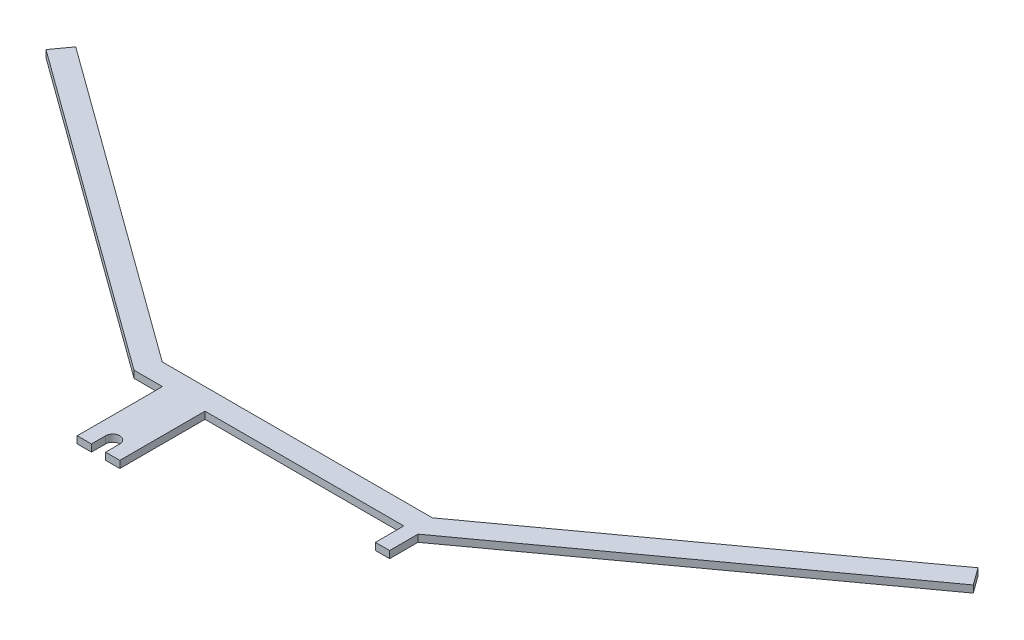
ISO-10303-21;
HEADER;
FILE_DESCRIPTION(('STEP AP214'),'2;1');
FILE_NAME('part.step','',(''),(''),'','','');
FILE_SCHEMA(('AUTOMOTIVE_DESIGN { 1 0 10303 214 1 1 1 1 }'));
ENDSEC;
DATA;
#1=APPLICATION_CONTEXT('core data for automotive mechanical design processes');
#2=APPLICATION_PROTOCOL_DEFINITION('international standard','automotive_design',2000,#1);
#3=PRODUCT_CONTEXT('',#1,'mechanical');
#4=PRODUCT('Part','Part','',(#3));
#5=PRODUCT_RELATED_PRODUCT_CATEGORY('part','',(#4));
#6=PRODUCT_DEFINITION_FORMATION('','',#4);
#7=PRODUCT_DEFINITION_CONTEXT('part definition',#1,'design');
#8=PRODUCT_DEFINITION('design','',#6,#7);
#9=PRODUCT_DEFINITION_SHAPE('','',#8);
#10=(LENGTH_UNIT() NAMED_UNIT(*) SI_UNIT(.MILLI.,.METRE.));
#11=(NAMED_UNIT(*) PLANE_ANGLE_UNIT() SI_UNIT($,.RADIAN.));
#12=(NAMED_UNIT(*) SI_UNIT($,.STERADIAN.) SOLID_ANGLE_UNIT());
#13=UNCERTAINTY_MEASURE_WITH_UNIT(LENGTH_MEASURE(1.E-05),#10,'distance_accuracy_value','');
#14=(GEOMETRIC_REPRESENTATION_CONTEXT(3) GLOBAL_UNCERTAINTY_ASSIGNED_CONTEXT((#13)) GLOBAL_UNIT_ASSIGNED_CONTEXT((#10,
#11,#12)) REPRESENTATION_CONTEXT('',''));
#15=CARTESIAN_POINT('',(0.,0.,0.));
#16=DIRECTION('',(0.,0.,1.));
#17=DIRECTION('',(1.,0.,0.));
#18=AXIS2_PLACEMENT_3D('',#15,#16,#17);
#19=CARTESIAN_POINT('',(-5.00000000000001,6.95820393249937,52.5));
#20=DIRECTION('',(0.,0.,1.));
#21=DIRECTION('',(1.,0.,0.));
#22=AXIS2_PLACEMENT_3D('',#19,#20,#21);
#23=PLANE('',#22);
#24=DIRECTION('',(0.,-1.,0.));
#25=VECTOR('',#24,1.);
#26=CARTESIAN_POINT('',(-7.00000000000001,6.95820393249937,52.5));
#27=LINE('',#26,#25);
#28=CARTESIAN_POINT('',(-7.00000000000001,0.250000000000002,52.5));
#29=VERTEX_POINT('',#28);
#30=CARTESIAN_POINT('',(-7.00000000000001,-0.25,52.5));
#31=VERTEX_POINT('',#30);
#32=EDGE_CURVE('E11',#29,#31,#27,.T.);
#33=ORIENTED_EDGE('',*,*,#32,.F.);
#34=DIRECTION('',(-1.,0.,0.));
#35=VECTOR('',#34,1.);
#36=CARTESIAN_POINT('',(-5.00000000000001,0.25,52.5));
#37=LINE('',#36,#35);
#38=CARTESIAN_POINT('',(-8.00000000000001,0.250000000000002,52.5));
#39=VERTEX_POINT('',#38);
#40=EDGE_CURVE('E246',#29,#39,#37,.T.);
#41=ORIENTED_EDGE('',*,*,#40,.T.);
#42=DIRECTION('',(0.,-1.,0.));
#43=VECTOR('',#42,1.);
#44=CARTESIAN_POINT('',(-8.00000000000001,6.95820393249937,52.5));
#45=LINE('',#44,#43);
#46=CARTESIAN_POINT('',(-8.00000000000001,-0.25,52.5));
#47=VERTEX_POINT('',#46);
#48=EDGE_CURVE('E245',#39,#47,#45,.T.);
#49=ORIENTED_EDGE('',*,*,#48,.T.);
#50=DIRECTION('',(-1.,0.,0.));
#51=VECTOR('',#50,1.);
#52=CARTESIAN_POINT('',(-5.00000000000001,-0.25,52.5));
#53=LINE('',#52,#51);
#54=EDGE_CURVE('E345',#31,#47,#53,.T.);
#55=ORIENTED_EDGE('',*,*,#54,.F.);
#56=EDGE_LOOP('',(#33,#41,#49,#55));
#57=FACE_BOUND('',#56,.T.);
#58=ADVANCED_FACE('F34',(#57),#23,.T.);
#59=CARTESIAN_POINT('',(-9.99999999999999,0.25,46.5));
#60=DIRECTION('',(0.,0.,-1.));
#61=DIRECTION('',(-1.,0.,0.));
#62=AXIS2_PLACEMENT_3D('',#59,#60,#61);
#63=PLANE('',#62);
#64=DIRECTION('',(1.,0.,0.));
#65=VECTOR('',#64,1.);
#66=CARTESIAN_POINT('',(-9.99999999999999,-0.25,46.5));
#67=LINE('',#66,#65);
#68=CARTESIAN_POINT('',(-9.99999999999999,-0.25,46.5));
#69=VERTEX_POINT('',#68);
#70=CARTESIAN_POINT('',(-8.00000000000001,-0.25,46.5));
#71=VERTEX_POINT('',#70);
#72=EDGE_CURVE('E161',#69,#71,#67,.T.);
#73=ORIENTED_EDGE('',*,*,#72,.T.);
#74=DIRECTION('',(0.,-1.,0.));
#75=VECTOR('',#74,1.);
#76=CARTESIAN_POINT('',(-8.00000000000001,6.95820393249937,46.5));
#77=LINE('',#76,#75);
#78=CARTESIAN_POINT('',(-8.00000000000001,0.25,46.5));
#79=VERTEX_POINT('',#78);
#80=EDGE_CURVE('E260',#79,#71,#77,.T.);
#81=ORIENTED_EDGE('',*,*,#80,.F.);
#82=DIRECTION('',(1.,0.,0.));
#83=VECTOR('',#82,1.);
#84=CARTESIAN_POINT('',(-9.99999999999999,0.25,46.5));
#85=LINE('',#84,#83);
#86=CARTESIAN_POINT('',(-9.99999999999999,0.250000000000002,46.5));
#87=VERTEX_POINT('',#86);
#88=EDGE_CURVE('E178',#87,#79,#85,.T.);
#89=ORIENTED_EDGE('',*,*,#88,.F.);
#90=DIRECTION('',(0.,-1.,0.));
#91=VECTOR('',#90,1.);
#92=CARTESIAN_POINT('',(-9.99999999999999,0.25,46.5));
#93=LINE('',#92,#91);
#94=EDGE_CURVE('E175',#87,#69,#93,.T.);
#95=ORIENTED_EDGE('',*,*,#94,.T.);
#96=EDGE_LOOP('',(#73,#81,#89,#95));
#97=FACE_BOUND('',#96,.T.);
#98=ADVANCED_FACE('F176',(#97),#63,.F.);
#99=CARTESIAN_POINT('',(-5.00000000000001,-0.25,46.5));
#100=VERTEX_POINT('',#99);
#101=CARTESIAN_POINT('',(8.99999999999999,-0.25,46.5));
#102=VERTEX_POINT('',#101);
#103=EDGE_CURVE('E54',#100,#102,#67,.T.);
#104=ORIENTED_EDGE('',*,*,#103,.T.);
#105=DIRECTION('',(0.,-1.,0.));
#106=VECTOR('',#105,1.);
#107=CARTESIAN_POINT('',(8.99999999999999,2.48606797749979,46.5));
#108=LINE('',#107,#106);
#109=CARTESIAN_POINT('',(8.99999999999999,0.25,46.5));
#110=VERTEX_POINT('',#109);
#111=EDGE_CURVE('E49',#110,#102,#108,.T.);
#112=ORIENTED_EDGE('',*,*,#111,.F.);
#113=CARTESIAN_POINT('',(-5.00000000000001,0.25,46.5));
#114=VERTEX_POINT('',#113);
#115=EDGE_CURVE('E268',#114,#110,#85,.T.);
#116=ORIENTED_EDGE('',*,*,#115,.F.);
#117=DIRECTION('',(0.,-1.,0.));
#118=VECTOR('',#117,1.);
#119=CARTESIAN_POINT('',(-5.00000000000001,6.95820393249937,46.5));
#120=LINE('',#119,#118);
#121=EDGE_CURVE('E257',#114,#100,#120,.T.);
#122=ORIENTED_EDGE('',*,*,#121,.T.);
#123=EDGE_LOOP('',(#104,#112,#116,#122));
#124=FACE_BOUND('',#123,.T.);
#125=ADVANCED_FACE('F379',(#124),#63,.F.);
#126=CARTESIAN_POINT('',(-31.7734222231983,0.25,28.831720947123));
#127=DIRECTION('',(0.809104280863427,0.,0.587665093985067));
#128=DIRECTION('',(0.587665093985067,0.,-0.809104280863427));
#129=AXIS2_PLACEMENT_3D('',#126,#127,#128);
#130=PLANE('',#129);
#131=DIRECTION('',(-0.587665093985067,0.,0.809104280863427));
#132=VECTOR('',#131,1.);
#133=CARTESIAN_POINT('',(-31.7734222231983,-0.25,28.831720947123));
#134=LINE('',#133,#132);
#135=CARTESIAN_POINT('',(-31.7734222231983,-0.25,28.831720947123));
#136=VERTEX_POINT('',#135);
#137=CARTESIAN_POINT('',(-32.6549198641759,-0.25,30.0453773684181));
#138=VERTEX_POINT('',#137);
#139=EDGE_CURVE('E187',#136,#138,#134,.T.);
#140=ORIENTED_EDGE('',*,*,#139,.T.);
#141=DIRECTION('',(0.,-1.,0.));
#142=VECTOR('',#141,1.);
#143=CARTESIAN_POINT('',(-32.6549198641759,0.25,30.0453773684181));
#144=LINE('',#143,#142);
#145=CARTESIAN_POINT('',(-32.6549198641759,0.25,30.0453773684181));
#146=VERTEX_POINT('',#145);
#147=EDGE_CURVE('E181',#146,#138,#144,.T.);
#148=ORIENTED_EDGE('',*,*,#147,.F.);
#149=DIRECTION('',(-0.587665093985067,0.,0.809104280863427));
#150=VECTOR('',#149,1.);
#151=CARTESIAN_POINT('',(-31.7734222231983,0.25,28.831720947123));
#152=LINE('',#151,#150);
#153=CARTESIAN_POINT('',(-31.7734222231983,0.25,28.831720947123));
#154=VERTEX_POINT('',#153);
#155=EDGE_CURVE('E202',#154,#146,#152,.T.);
#156=ORIENTED_EDGE('',*,*,#155,.F.);
#157=DIRECTION('',(0.,-1.,0.));
#158=VECTOR('',#157,1.);
#159=CARTESIAN_POINT('',(-31.7734222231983,0.25,28.831720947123));
#160=LINE('',#159,#158);
#161=EDGE_CURVE('E203',#154,#136,#160,.T.);
#162=ORIENTED_EDGE('',*,*,#161,.T.);
#163=EDGE_LOOP('',(#140,#148,#156,#162));
#164=FACE_BOUND('',#163,.T.);
#165=ADVANCED_FACE('F36',(#164),#130,.F.);
#166=CARTESIAN_POINT('',(-32.6549198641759,0.25,30.0453773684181));
#167=DIRECTION('',(0.587665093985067,0.,-0.809104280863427));
#168=DIRECTION('',(-0.809104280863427,0.,-0.587665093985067));
#169=AXIS2_PLACEMENT_3D('',#166,#167,#168);
#170=PLANE('',#169);
#171=DIRECTION('',(0.809104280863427,0.,0.587665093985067));
#172=VECTOR('',#171,1.);
#173=CARTESIAN_POINT('',(-32.6549198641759,-0.25,30.0453773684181));
#174=LINE('',#173,#172);
#175=EDGE_CURVE('E166',#138,#69,#174,.T.);
#176=ORIENTED_EDGE('',*,*,#175,.T.);
#177=ORIENTED_EDGE('',*,*,#94,.F.);
#178=DIRECTION('',(0.809104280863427,0.,0.587665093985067));
#179=VECTOR('',#178,1.);
#180=CARTESIAN_POINT('',(-32.6549198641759,0.25,30.0453773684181));
#181=LINE('',#180,#179);
#182=EDGE_CURVE('E266',#146,#87,#181,.T.);
#183=ORIENTED_EDGE('',*,*,#182,.F.);
#184=ORIENTED_EDGE('',*,*,#147,.T.);
#185=EDGE_LOOP('',(#176,#177,#183,#184));
#186=FACE_BOUND('',#185,.T.);
#187=ADVANCED_FACE('F184',(#186),#170,.F.);
#188=CARTESIAN_POINT('',(32.654919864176,0.25,30.0453773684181));
#189=DIRECTION('',(-0.587665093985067,0.,-0.809104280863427));
#190=DIRECTION('',(-0.809104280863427,0.,0.587665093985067));
#191=AXIS2_PLACEMENT_3D('',#188,#189,#190);
#192=PLANE('',#191);
#193=DIRECTION('',(0.809104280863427,0.,-0.587665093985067));
#194=VECTOR('',#193,1.);
#195=CARTESIAN_POINT('',(32.654919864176,-0.25,30.0453773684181));
#196=LINE('',#195,#194);
#197=CARTESIAN_POINT('',(9.99999999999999,-0.25,46.5));
#198=VERTEX_POINT('',#197);
#199=CARTESIAN_POINT('',(32.654919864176,-0.25,30.0453773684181));
#200=VERTEX_POINT('',#199);
#201=EDGE_CURVE('E172',#198,#200,#196,.T.);
#202=ORIENTED_EDGE('',*,*,#201,.T.);
#203=DIRECTION('',(0.,-1.,0.));
#204=VECTOR('',#203,1.);
#205=CARTESIAN_POINT('',(32.654919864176,0.25,30.0453773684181));
#206=LINE('',#205,#204);
#207=CARTESIAN_POINT('',(32.654919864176,0.25,30.0453773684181));
#208=VERTEX_POINT('',#207);
#209=EDGE_CURVE('E216',#208,#200,#206,.T.);
#210=ORIENTED_EDGE('',*,*,#209,.F.);
#211=DIRECTION('',(0.809104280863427,0.,-0.587665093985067));
#212=VECTOR('',#211,1.);
#213=CARTESIAN_POINT('',(32.654919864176,0.25,30.0453773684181));
#214=LINE('',#213,#212);
#215=CARTESIAN_POINT('',(9.99999999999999,0.25,46.5));
#216=VERTEX_POINT('',#215);
#217=EDGE_CURVE('E270',#216,#208,#214,.T.);
#218=ORIENTED_EDGE('',*,*,#217,.F.);
#219=DIRECTION('',(0.,-1.,0.));
#220=VECTOR('',#219,1.);
#221=CARTESIAN_POINT('',(10.,0.25,46.5));
#222=LINE('',#221,#220);
#223=EDGE_CURVE('E182',#216,#198,#222,.T.);
#224=ORIENTED_EDGE('',*,*,#223,.T.);
#225=EDGE_LOOP('',(#202,#210,#218,#224));
#226=FACE_BOUND('',#225,.T.);
#227=ADVANCED_FACE('F361',(#226),#192,.F.);
#228=CARTESIAN_POINT('',(31.7734222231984,0.25,28.831720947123));
#229=DIRECTION('',(-0.809104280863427,0.,0.587665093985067));
#230=DIRECTION('',(0.587665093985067,0.,0.809104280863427));
#231=AXIS2_PLACEMENT_3D('',#228,#229,#230);
#232=PLANE('',#231);
#233=DIRECTION('',(-0.587665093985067,0.,-0.809104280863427));
#234=VECTOR('',#233,1.);
#235=CARTESIAN_POINT('',(31.7734222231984,-0.25,28.831720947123));
#236=LINE('',#235,#234);
#237=CARTESIAN_POINT('',(31.7734222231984,-0.25,28.831720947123));
#238=VERTEX_POINT('',#237);
#239=EDGE_CURVE('E194',#200,#238,#236,.T.);
#240=ORIENTED_EDGE('',*,*,#239,.T.);
#241=DIRECTION('',(0.,-1.,0.));
#242=VECTOR('',#241,1.);
#243=CARTESIAN_POINT('',(31.7734222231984,0.25,28.831720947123));
#244=LINE('',#243,#242);
#245=CARTESIAN_POINT('',(31.7734222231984,0.25,28.831720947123));
#246=VERTEX_POINT('',#245);
#247=EDGE_CURVE('E213',#246,#238,#244,.T.);
#248=ORIENTED_EDGE('',*,*,#247,.F.);
#249=DIRECTION('',(-0.587665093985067,0.,-0.809104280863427));
#250=VECTOR('',#249,1.);
#251=CARTESIAN_POINT('',(31.7734222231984,0.25,28.831720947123));
#252=LINE('',#251,#250);
#253=EDGE_CURVE('E272',#208,#246,#252,.T.);
#254=ORIENTED_EDGE('',*,*,#253,.F.);
#255=ORIENTED_EDGE('',*,*,#209,.T.);
#256=EDGE_LOOP('',(#240,#248,#254,#255));
#257=FACE_BOUND('',#256,.T.);
#258=ADVANCED_FACE('F298',(#257),#232,.F.);
#259=CARTESIAN_POINT('',(31.7734222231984,0.25,28.831720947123));
#260=DIRECTION('',(0.587665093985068,0.,0.809104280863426));
#261=DIRECTION('',(0.809104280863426,0.,-0.587665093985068));
#262=AXIS2_PLACEMENT_3D('',#259,#260,#261);
#263=PLANE('',#262);
#264=DIRECTION('',(-0.809104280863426,0.,0.587665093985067));
#265=VECTOR('',#264,1.);
#266=CARTESIAN_POINT('',(31.7734222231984,-0.25,28.831720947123));
#267=LINE('',#266,#265);
#268=CARTESIAN_POINT('',(9.51274359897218,-0.25,45.));
#269=VERTEX_POINT('',#268);
#270=EDGE_CURVE('E196',#238,#269,#267,.T.);
#271=ORIENTED_EDGE('',*,*,#270,.T.);
#272=DIRECTION('',(0.,-1.,0.));
#273=VECTOR('',#272,1.);
#274=CARTESIAN_POINT('',(9.51274359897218,0.25,45.));
#275=LINE('',#274,#273);
#276=CARTESIAN_POINT('',(9.51274359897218,0.25,45.));
#277=VERTEX_POINT('',#276);
#278=EDGE_CURVE('E210',#277,#269,#275,.T.);
#279=ORIENTED_EDGE('',*,*,#278,.F.);
#280=DIRECTION('',(-0.809104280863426,0.,0.587665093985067));
#281=VECTOR('',#280,1.);
#282=CARTESIAN_POINT('',(31.7734222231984,0.25,28.831720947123));
#283=LINE('',#282,#281);
#284=EDGE_CURVE('E274',#246,#277,#283,.T.);
#285=ORIENTED_EDGE('',*,*,#284,.F.);
#286=ORIENTED_EDGE('',*,*,#247,.T.);
#287=EDGE_LOOP('',(#271,#279,#285,#286));
#288=FACE_BOUND('',#287,.T.);
#289=ADVANCED_FACE('F294',(#288),#263,.F.);
#290=CARTESIAN_POINT('',(-9.51274359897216,0.25,45.));
#291=DIRECTION('',(0.,0.,1.));
#292=DIRECTION('',(1.,0.,0.));
#293=AXIS2_PLACEMENT_3D('',#290,#291,#292);
#294=PLANE('',#293);
#295=DIRECTION('',(-1.,0.,0.));
#296=VECTOR('',#295,1.);
#297=CARTESIAN_POINT('',(-9.51274359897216,-0.25,45.));
#298=LINE('',#297,#296);
#299=CARTESIAN_POINT('',(-9.51274359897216,-0.25,45.));
#300=VERTEX_POINT('',#299);
#301=EDGE_CURVE('E198',#269,#300,#298,.T.);
#302=ORIENTED_EDGE('',*,*,#301,.T.);
#303=DIRECTION('',(0.,-1.,0.));
#304=VECTOR('',#303,1.);
#305=CARTESIAN_POINT('',(-9.51274359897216,0.25,45.));
#306=LINE('',#305,#304);
#307=CARTESIAN_POINT('',(-9.51274359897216,0.25,45.));
#308=VERTEX_POINT('',#307);
#309=EDGE_CURVE('E206',#308,#300,#306,.T.);
#310=ORIENTED_EDGE('',*,*,#309,.F.);
#311=DIRECTION('',(-1.,0.,0.));
#312=VECTOR('',#311,1.);
#313=CARTESIAN_POINT('',(-9.51274359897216,0.25,45.));
#314=LINE('',#313,#312);
#315=EDGE_CURVE('E276',#277,#308,#314,.T.);
#316=ORIENTED_EDGE('',*,*,#315,.F.);
#317=ORIENTED_EDGE('',*,*,#278,.T.);
#318=EDGE_LOOP('',(#302,#310,#316,#317));
#319=FACE_BOUND('',#318,.T.);
#320=ADVANCED_FACE('F290',(#319),#294,.F.);
#321=CARTESIAN_POINT('',(-31.7734222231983,0.25,28.831720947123));
#322=DIRECTION('',(-0.587665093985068,0.,0.809104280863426));
#323=DIRECTION('',(0.809104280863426,0.,0.587665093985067));
#324=AXIS2_PLACEMENT_3D('',#321,#322,#323);
#325=PLANE('',#324);
#326=DIRECTION('',(-0.809104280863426,0.,-0.587665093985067));
#327=VECTOR('',#326,1.);
#328=CARTESIAN_POINT('',(-31.7734222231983,-0.25,28.831720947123));
#329=LINE('',#328,#327);
#330=EDGE_CURVE('E200',#300,#136,#329,.T.);
#331=ORIENTED_EDGE('',*,*,#330,.T.);
#332=ORIENTED_EDGE('',*,*,#161,.F.);
#333=DIRECTION('',(-0.809104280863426,0.,-0.587665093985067));
#334=VECTOR('',#333,1.);
#335=CARTESIAN_POINT('',(-31.7734222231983,0.25,28.831720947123));
#336=LINE('',#335,#334);
#337=EDGE_CURVE('E207',#308,#154,#336,.T.);
#338=ORIENTED_EDGE('',*,*,#337,.F.);
#339=ORIENTED_EDGE('',*,*,#309,.T.);
#340=EDGE_LOOP('',(#331,#332,#338,#339));
#341=FACE_BOUND('',#340,.T.);
#342=ADVANCED_FACE('F283',(#341),#325,.F.);
#343=CARTESIAN_POINT('',(0.,0.25,0.));
#344=DIRECTION('',(0.,1.,0.));
#345=DIRECTION('',(0.,0.,1.));
#346=AXIS2_PLACEMENT_3D('',#343,#344,#345);
#347=PLANE('',#346);
#348=ORIENTED_EDGE('',*,*,#182,.T.);
#349=ORIENTED_EDGE('',*,*,#88,.T.);
#350=DIRECTION('',(0.,0.,-1.));
#351=VECTOR('',#350,1.);
#352=CARTESIAN_POINT('',(-8.00000000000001,0.25,46.5));
#353=LINE('',#352,#351);
#354=EDGE_CURVE('E249',#39,#79,#353,.T.);
#355=ORIENTED_EDGE('',*,*,#354,.F.);
#356=ORIENTED_EDGE('',*,*,#40,.F.);
#357=DIRECTION('',(0.,0.,-1.));
#358=VECTOR('',#357,1.);
#359=CARTESIAN_POINT('',(-7.00000000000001,0.250000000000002,51.5));
#360=LINE('',#359,#358);
#361=CARTESIAN_POINT('',(-7.00000000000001,0.250000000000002,51.5));
#362=VERTEX_POINT('',#361);
#363=EDGE_CURVE('E241',#29,#362,#360,.T.);
#364=ORIENTED_EDGE('',*,*,#363,.T.);
#365=CARTESIAN_POINT('',(-6.50000000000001,0.250000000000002,51.5));
#366=DIRECTION('',(0.,-1.,0.));
#367=DIRECTION('',(0.,0.,-1.));
#368=AXIS2_PLACEMENT_3D('',#365,#366,#367);
#369=CIRCLE('',#368,0.5);
#370=CARTESIAN_POINT('',(-6.00000000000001,0.250000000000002,51.5));
#371=VERTEX_POINT('',#370);
#372=EDGE_CURVE('E240',#362,#371,#369,.T.);
#373=ORIENTED_EDGE('',*,*,#372,.T.);
#374=DIRECTION('',(0.,0.,1.));
#375=VECTOR('',#374,1.);
#376=CARTESIAN_POINT('',(-6.00000000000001,0.250000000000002,55.2784134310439));
#377=LINE('',#376,#375);
#378=CARTESIAN_POINT('',(-6.00000000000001,0.250000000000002,52.5));
#379=VERTEX_POINT('',#378);
#380=EDGE_CURVE('E225',#371,#379,#377,.T.);
#381=ORIENTED_EDGE('',*,*,#380,.T.);
#382=CARTESIAN_POINT('',(-5.00000000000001,0.25,52.5));
#383=VERTEX_POINT('',#382);
#384=EDGE_CURVE('E236',#383,#379,#37,.T.);
#385=ORIENTED_EDGE('',*,*,#384,.F.);
#386=DIRECTION('',(0.,0.,1.));
#387=VECTOR('',#386,1.);
#388=CARTESIAN_POINT('',(-5.00000000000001,0.25,46.5));
#389=LINE('',#388,#387);
#390=EDGE_CURVE('E255',#114,#383,#389,.T.);
#391=ORIENTED_EDGE('',*,*,#390,.F.);
#392=ORIENTED_EDGE('',*,*,#115,.T.);
#393=DIRECTION('',(0.,0.,-1.));
#394=VECTOR('',#393,1.);
#395=CARTESIAN_POINT('',(8.99999999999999,0.25,48.5));
#396=LINE('',#395,#394);
#397=CARTESIAN_POINT('',(8.99999999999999,0.25,48.5));
#398=VERTEX_POINT('',#397);
#399=EDGE_CURVE('E321',#398,#110,#396,.T.);
#400=ORIENTED_EDGE('',*,*,#399,.F.);
#401=DIRECTION('',(-1.,0.,0.));
#402=VECTOR('',#401,1.);
#403=CARTESIAN_POINT('',(9.99999999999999,0.25,48.5));
#404=LINE('',#403,#402);
#405=CARTESIAN_POINT('',(9.99999999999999,0.25,48.5));
#406=VERTEX_POINT('',#405);
#407=EDGE_CURVE('E325',#406,#398,#404,.T.);
#408=ORIENTED_EDGE('',*,*,#407,.F.);
#409=DIRECTION('',(0.,0.,1.));
#410=VECTOR('',#409,1.);
#411=CARTESIAN_POINT('',(9.99999999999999,0.25,46.5));
#412=LINE('',#411,#410);
#413=EDGE_CURVE('E319',#216,#406,#412,.T.);
#414=ORIENTED_EDGE('',*,*,#413,.F.);
#415=ORIENTED_EDGE('',*,*,#217,.T.);
#416=ORIENTED_EDGE('',*,*,#253,.T.);
#417=ORIENTED_EDGE('',*,*,#284,.T.);
#418=ORIENTED_EDGE('',*,*,#315,.T.);
#419=ORIENTED_EDGE('',*,*,#337,.T.);
#420=ORIENTED_EDGE('',*,*,#155,.T.);
#421=EDGE_LOOP('',(#348,#349,#355,#356,#364,#373,#381,#385,#391,#392,#400,#408,#414,#415,#416,
#417,#418,#419,#420));
#422=FACE_BOUND('',#421,.T.);
#423=ADVANCED_FACE('F234',(#422),#347,.T.);
#424=CARTESIAN_POINT('',(0.,-0.25,0.));
#425=DIRECTION('',(0.,1.,0.));
#426=DIRECTION('',(0.,0.,1.));
#427=AXIS2_PLACEMENT_3D('',#424,#425,#426);
#428=PLANE('',#427);
#429=ORIENTED_EDGE('',*,*,#72,.F.);
#430=ORIENTED_EDGE('',*,*,#175,.F.);
#431=ORIENTED_EDGE('',*,*,#139,.F.);
#432=ORIENTED_EDGE('',*,*,#330,.F.);
#433=ORIENTED_EDGE('',*,*,#301,.F.);
#434=ORIENTED_EDGE('',*,*,#270,.F.);
#435=ORIENTED_EDGE('',*,*,#239,.F.);
#436=ORIENTED_EDGE('',*,*,#201,.F.);
#437=DIRECTION('',(0.,0.,1.));
#438=VECTOR('',#437,1.);
#439=CARTESIAN_POINT('',(9.99999999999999,-0.25,46.5));
#440=LINE('',#439,#438);
#441=CARTESIAN_POINT('',(9.99999999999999,-0.25,48.5));
#442=VERTEX_POINT('',#441);
#443=EDGE_CURVE('E304',#198,#442,#440,.T.);
#444=ORIENTED_EDGE('',*,*,#443,.T.);
#445=DIRECTION('',(-1.,0.,0.));
#446=VECTOR('',#445,1.);
#447=CARTESIAN_POINT('',(9.99999999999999,-0.25,48.5));
#448=LINE('',#447,#446);
#449=CARTESIAN_POINT('',(8.99999999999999,-0.25,48.5));
#450=VERTEX_POINT('',#449);
#451=EDGE_CURVE('E313',#442,#450,#448,.T.);
#452=ORIENTED_EDGE('',*,*,#451,.T.);
#453=DIRECTION('',(0.,0.,-1.));
#454=VECTOR('',#453,1.);
#455=CARTESIAN_POINT('',(8.99999999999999,-0.25,48.5));
#456=LINE('',#455,#454);
#457=EDGE_CURVE('E315',#450,#102,#456,.T.);
#458=ORIENTED_EDGE('',*,*,#457,.T.);
#459=ORIENTED_EDGE('',*,*,#103,.F.);
#460=DIRECTION('',(0.,0.,1.));
#461=VECTOR('',#460,1.);
#462=CARTESIAN_POINT('',(-5.00000000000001,-0.25,46.5));
#463=LINE('',#462,#461);
#464=CARTESIAN_POINT('',(-5.00000000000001,-0.25,52.5));
#465=VERTEX_POINT('',#464);
#466=EDGE_CURVE('E253',#100,#465,#463,.T.);
#467=ORIENTED_EDGE('',*,*,#466,.T.);
#468=CARTESIAN_POINT('',(-6.00000000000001,-0.25,52.5));
#469=VERTEX_POINT('',#468);
#470=EDGE_CURVE('E344',#465,#469,#53,.T.);
#471=ORIENTED_EDGE('',*,*,#470,.T.);
#472=DIRECTION('',(0.,0.,1.));
#473=VECTOR('',#472,1.);
#474=CARTESIAN_POINT('',(-6.00000000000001,-0.25,55.2784134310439));
#475=LINE('',#474,#473);
#476=CARTESIAN_POINT('',(-6.00000000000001,-0.25,51.5));
#477=VERTEX_POINT('',#476);
#478=EDGE_CURVE('E228',#477,#469,#475,.T.);
#479=ORIENTED_EDGE('',*,*,#478,.F.);
#480=CARTESIAN_POINT('',(-6.50000000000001,-0.25,51.5));
#481=DIRECTION('',(0.,-1.,0.));
#482=DIRECTION('',(0.,0.,-1.));
#483=AXIS2_PLACEMENT_3D('',#480,#481,#482);
#484=CIRCLE('',#483,0.5);
#485=CARTESIAN_POINT('',(-7.00000000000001,-0.25,51.5));
#486=VERTEX_POINT('',#485);
#487=EDGE_CURVE('E329',#486,#477,#484,.T.);
#488=ORIENTED_EDGE('',*,*,#487,.F.);
#489=DIRECTION('',(0.,0.,-1.));
#490=VECTOR('',#489,1.);
#491=CARTESIAN_POINT('',(-7.00000000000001,-0.25,51.5));
#492=LINE('',#491,#490);
#493=EDGE_CURVE('E332',#31,#486,#492,.T.);
#494=ORIENTED_EDGE('',*,*,#493,.F.);
#495=ORIENTED_EDGE('',*,*,#54,.T.);
#496=DIRECTION('',(0.,0.,-1.));
#497=VECTOR('',#496,1.);
#498=CARTESIAN_POINT('',(-8.00000000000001,-0.25,46.5));
#499=LINE('',#498,#497);
#500=EDGE_CURVE('E169',#47,#71,#499,.T.);
#501=ORIENTED_EDGE('',*,*,#500,.T.);
#502=EDGE_LOOP('',(#429,#430,#431,#432,#433,#434,#435,#436,#444,#452,#458,#459,#467,#471,#479,
#488,#494,#495,#501));
#503=FACE_BOUND('',#502,.T.);
#504=ADVANCED_FACE('F163',(#503),#428,.F.);
#505=DIRECTION('',(0.,1.,0.));
#506=VECTOR('',#505,1.);
#507=CARTESIAN_POINT('',(-6.00000000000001,6.95820393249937,52.5));
#508=LINE('',#507,#506);
#509=EDGE_CURVE('E42',#469,#379,#508,.T.);
#510=ORIENTED_EDGE('',*,*,#509,.F.);
#511=ORIENTED_EDGE('',*,*,#470,.F.);
#512=DIRECTION('',(0.,-1.,0.));
#513=VECTOR('',#512,1.);
#514=CARTESIAN_POINT('',(-5.00000000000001,6.95820393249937,52.5));
#515=LINE('',#514,#513);
#516=EDGE_CURVE('E189',#383,#465,#515,.T.);
#517=ORIENTED_EDGE('',*,*,#516,.F.);
#518=ORIENTED_EDGE('',*,*,#384,.T.);
#519=EDGE_LOOP('',(#510,#511,#517,#518));
#520=FACE_BOUND('',#519,.T.);
#521=ADVANCED_FACE('F244',(#520),#23,.T.);
#522=CARTESIAN_POINT('',(-8.00000000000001,6.95820393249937,46.5));
#523=DIRECTION('',(-1.,0.,0.));
#524=DIRECTION('',(0.,0.,1.));
#525=AXIS2_PLACEMENT_3D('',#522,#523,#524);
#526=PLANE('',#525);
#527=ORIENTED_EDGE('',*,*,#48,.F.);
#528=ORIENTED_EDGE('',*,*,#354,.T.);
#529=ORIENTED_EDGE('',*,*,#80,.T.);
#530=ORIENTED_EDGE('',*,*,#500,.F.);
#531=EDGE_LOOP('',(#527,#528,#529,#530));
#532=FACE_BOUND('',#531,.T.);
#533=ADVANCED_FACE('F384',(#532),#526,.T.);
#534=CARTESIAN_POINT('',(-5.00000000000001,6.95820393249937,46.5));
#535=DIRECTION('',(1.,0.,0.));
#536=DIRECTION('',(0.,0.,-1.));
#537=AXIS2_PLACEMENT_3D('',#534,#535,#536);
#538=PLANE('',#537);
#539=ORIENTED_EDGE('',*,*,#121,.F.);
#540=ORIENTED_EDGE('',*,*,#390,.T.);
#541=ORIENTED_EDGE('',*,*,#516,.T.);
#542=ORIENTED_EDGE('',*,*,#466,.F.);
#543=EDGE_LOOP('',(#539,#540,#541,#542));
#544=FACE_BOUND('',#543,.T.);
#545=ADVANCED_FACE('F353',(#544),#538,.T.);
#546=CARTESIAN_POINT('',(-6.50000000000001,0.250000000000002,51.5));
#547=DIRECTION('',(0.,-1.,0.));
#548=DIRECTION('',(0.,0.,-1.));
#549=AXIS2_PLACEMENT_3D('',#546,#547,#548);
#550=CYLINDRICAL_SURFACE('',#549,0.5);
#551=ORIENTED_EDGE('',*,*,#487,.T.);
#552=DIRECTION('',(0.,-1.,0.));
#553=VECTOR('',#552,1.);
#554=CARTESIAN_POINT('',(-6.00000000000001,0.250000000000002,51.5));
#555=LINE('',#554,#553);
#556=EDGE_CURVE('E335',#371,#477,#555,.T.);
#557=ORIENTED_EDGE('',*,*,#556,.F.);
#558=ORIENTED_EDGE('',*,*,#372,.F.);
#559=DIRECTION('',(0.,-1.,0.));
#560=VECTOR('',#559,1.);
#561=CARTESIAN_POINT('',(-7.00000000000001,0.250000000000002,51.5));
#562=LINE('',#561,#560);
#563=EDGE_CURVE('E340',#362,#486,#562,.T.);
#564=ORIENTED_EDGE('',*,*,#563,.T.);
#565=EDGE_LOOP('',(#551,#557,#558,#564));
#566=FACE_BOUND('',#565,.T.);
#567=ADVANCED_FACE('F428',(#566),#550,.F.);
#568=CARTESIAN_POINT('',(-7.00000000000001,0.250000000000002,51.5));
#569=DIRECTION('',(-1.,0.,0.));
#570=DIRECTION('',(0.,0.,1.));
#571=AXIS2_PLACEMENT_3D('',#568,#569,#570);
#572=PLANE('',#571);
#573=ORIENTED_EDGE('',*,*,#32,.T.);
#574=ORIENTED_EDGE('',*,*,#493,.T.);
#575=ORIENTED_EDGE('',*,*,#563,.F.);
#576=ORIENTED_EDGE('',*,*,#363,.F.);
#577=EDGE_LOOP('',(#573,#574,#575,#576));
#578=FACE_BOUND('',#577,.T.);
#579=ADVANCED_FACE('F446',(#578),#572,.F.);
#580=CARTESIAN_POINT('',(-6.00000000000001,0.250000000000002,55.2784134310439));
#581=DIRECTION('',(1.,0.,0.));
#582=DIRECTION('',(0.,0.,-1.));
#583=AXIS2_PLACEMENT_3D('',#580,#581,#582);
#584=PLANE('',#583);
#585=ORIENTED_EDGE('',*,*,#509,.T.);
#586=ORIENTED_EDGE('',*,*,#380,.F.);
#587=ORIENTED_EDGE('',*,*,#556,.T.);
#588=ORIENTED_EDGE('',*,*,#478,.T.);
#589=EDGE_LOOP('',(#585,#586,#587,#588));
#590=FACE_BOUND('',#589,.T.);
#591=ADVANCED_FACE('F224',(#590),#584,.F.);
#592=CARTESIAN_POINT('',(9.99999999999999,2.48606797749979,46.5));
#593=DIRECTION('',(1.,0.,0.));
#594=DIRECTION('',(0.,0.,-1.));
#595=AXIS2_PLACEMENT_3D('',#592,#593,#594);
#596=PLANE('',#595);
#597=ORIENTED_EDGE('',*,*,#223,.F.);
#598=ORIENTED_EDGE('',*,*,#413,.T.);
#599=DIRECTION('',(0.,-1.,0.));
#600=VECTOR('',#599,1.);
#601=CARTESIAN_POINT('',(9.99999999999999,2.48606797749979,48.5));
#602=LINE('',#601,#600);
#603=EDGE_CURVE('E311',#406,#442,#602,.T.);
#604=ORIENTED_EDGE('',*,*,#603,.T.);
#605=ORIENTED_EDGE('',*,*,#443,.F.);
#606=EDGE_LOOP('',(#597,#598,#604,#605));
#607=FACE_BOUND('',#606,.T.);
#608=ADVANCED_FACE('F308',(#607),#596,.T.);
#609=CARTESIAN_POINT('',(9.99999999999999,2.48606797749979,48.5));
#610=DIRECTION('',(0.,0.,1.));
#611=DIRECTION('',(1.,0.,0.));
#612=AXIS2_PLACEMENT_3D('',#609,#610,#611);
#613=PLANE('',#612);
#614=ORIENTED_EDGE('',*,*,#603,.F.);
#615=ORIENTED_EDGE('',*,*,#407,.T.);
#616=DIRECTION('',(0.,-1.,0.));
#617=VECTOR('',#616,1.);
#618=CARTESIAN_POINT('',(8.99999999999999,2.48606797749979,48.5));
#619=LINE('',#618,#617);
#620=EDGE_CURVE('E324',#398,#450,#619,.T.);
#621=ORIENTED_EDGE('',*,*,#620,.T.);
#622=ORIENTED_EDGE('',*,*,#451,.F.);
#623=EDGE_LOOP('',(#614,#615,#621,#622));
#624=FACE_BOUND('',#623,.T.);
#625=ADVANCED_FACE('F359',(#624),#613,.T.);
#626=CARTESIAN_POINT('',(8.99999999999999,2.48606797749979,48.5));
#627=DIRECTION('',(-1.,0.,0.));
#628=DIRECTION('',(0.,0.,1.));
#629=AXIS2_PLACEMENT_3D('',#626,#627,#628);
#630=PLANE('',#629);
#631=ORIENTED_EDGE('',*,*,#620,.F.);
#632=ORIENTED_EDGE('',*,*,#399,.T.);
#633=ORIENTED_EDGE('',*,*,#111,.T.);
#634=ORIENTED_EDGE('',*,*,#457,.F.);
#635=EDGE_LOOP('',(#631,#632,#633,#634));
#636=FACE_BOUND('',#635,.T.);
#637=ADVANCED_FACE('F356',(#636),#630,.T.);
#638=CLOSED_SHELL('',(#58,#98,#125,#165,#187,#227,#258,#289,#320,#342,#423,#504,#521,#533,#545,
#567,#579,#591,#608,#625,#637));
#639=MANIFOLD_SOLID_BREP('B2',#638);
#640=ADVANCED_BREP_SHAPE_REPRESENTATION('',(#18,#639),#14);
#641=SHAPE_DEFINITION_REPRESENTATION(#9,#640);
ENDSEC;
END-ISO-10303-21;
